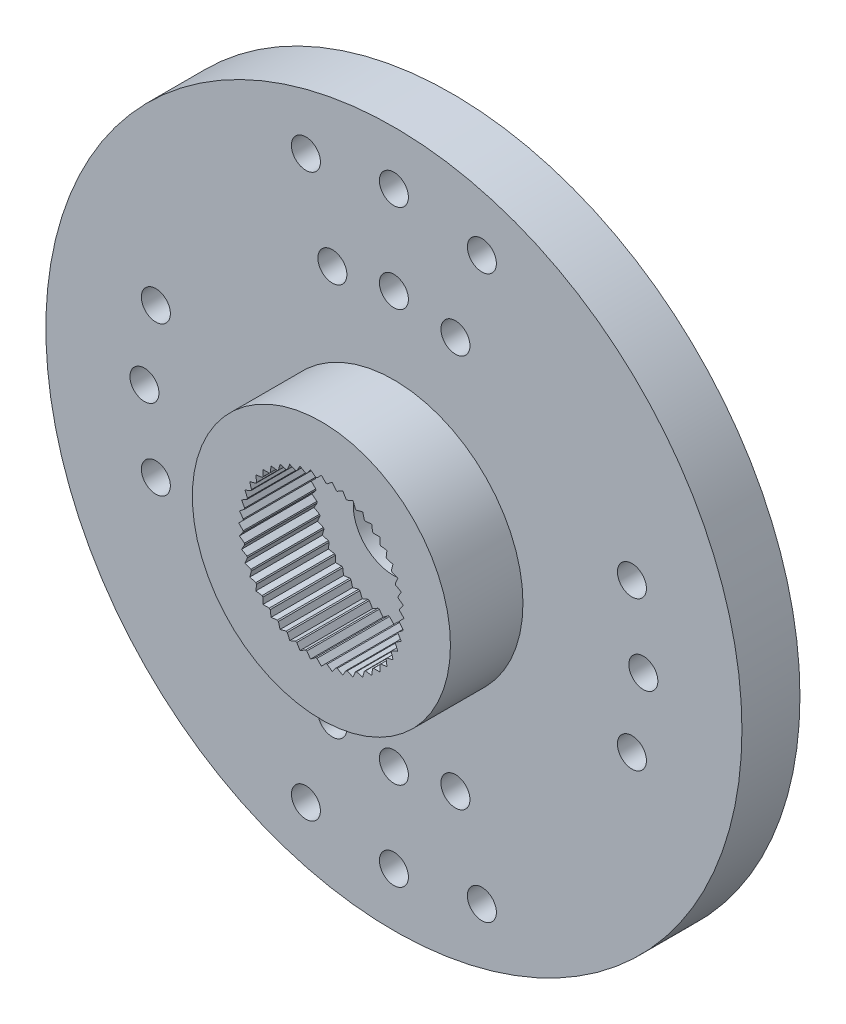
from build123d import *

# Parameters (mm, degrees)
ESQUISSE2_R             = 4.45
BOSS_EXTRU_1_DEPTH      = 3.2
BOSS_EXTRU_2_START      = -2.5
ESQUISSE3_R             = 12
ESQUISSE3_R_2           = 0.5
BOSS_EXTRU_2_DEPTH      = 2
ESQUISSE4_R             = 1.4
ENL_V_MAT_EXTRU_1_DEPTH = 18.557049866
ESQUISSE5_R             = 3.7
ESQUISSE5_R_2           = 2.9
EXTRU_MINCE1_DEPTH      = 0.4


with BuildPart() as part:
    # Esquisse2 → Boss.-Extru.1 (new body)
    with BuildSketch(Plane.XY):
        Circle(ESQUISSE2_R)
        with BuildLine():
            Line((0, 2.85), (-0.154419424, 2.695580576))
            ThreePointArc((-0.154419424, 2.695580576), (-0.176588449, 2.694219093), (-0.198745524, 2.69267529))
            Line((-0.198745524, 2.69267529), (-0.371999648, 2.825617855))
            Line((-0.371999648, 2.825617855), (-0.504942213, 2.652363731))
            ThreePointArc((-0.504942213, 2.652363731), (-0.526743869, 2.648120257), (-0.548509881, 2.643697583))
            Line((-0.548509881, 2.643697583), (-0.737634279, 2.752888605))
            Line((-0.737634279, 2.752888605), (-0.8468253, 2.563764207))
            ThreePointArc((-0.8468253, 2.563764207), (-0.867886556, 2.55671135), (-0.888889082, 2.549485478))
            Line((-0.888889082, 2.549485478), (-1.090647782, 2.633056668))
            Line((-1.090647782, 2.633056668), (-1.174218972, 2.431297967))
            ThreePointArc((-1.174218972, 2.431297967), (-1.194179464, 2.421556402), (-1.214059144, 2.411650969))
            Line((-1.214059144, 2.411650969), (-1.425, 2.468172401))
            Line((-1.425, 2.468172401), (-1.481521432, 2.257231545))
            ThreePointArc((-1.481521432, 2.257231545), (-1.500039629, 2.244967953), (-1.518456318, 2.232552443))
            Line((-1.518456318, 2.232552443), (-1.734970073, 2.26105702))
            Line((-1.734970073, 2.26105702), (-1.763474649, 2.044543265))
            ThreePointArc((-1.763474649, 2.044543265), (-1.780233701, 2.02996748), (-1.796872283, 2.015254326))
            Line((-1.796872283, 2.015254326), (-2.015254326, 2.015254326))
            Line((-2.015254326, 2.015254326), (-2.015254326, 1.796872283))
            ThreePointArc((-2.015254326, 1.796872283), (-2.02996748, 1.780233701), (-2.044543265, 1.763474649))
            Line((-2.044543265, 1.763474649), (-2.26105702, 1.734970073))
            Line((-2.26105702, 1.734970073), (-2.232552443, 1.518456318))
            ThreePointArc((-2.232552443, 1.518456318), (-2.244967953, 1.500039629), (-2.257231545, 1.481521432))
            Line((-2.257231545, 1.481521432), (-2.468172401, 1.425))
            Line((-2.468172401, 1.425), (-2.411650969, 1.214059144))
            ThreePointArc((-2.411650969, 1.214059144), (-2.421556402, 1.194179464), (-2.431297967, 1.174218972))
            Line((-2.431297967, 1.174218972), (-2.633056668, 1.090647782))
            Line((-2.633056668, 1.090647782), (-2.549485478, 0.888889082))
            ThreePointArc((-2.549485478, 0.888889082), (-2.55671135, 0.867886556), (-2.563764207, 0.8468253))
            Line((-2.563764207, 0.8468253), (-2.752888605, 0.737634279))
            Line((-2.752888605, 0.737634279), (-2.643697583, 0.548509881))
            ThreePointArc((-2.643697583, 0.548509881), (-2.648120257, 0.526743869), (-2.652363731, 0.504942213))
            Line((-2.652363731, 0.504942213), (-2.825617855, 0.371999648))
            Line((-2.825617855, 0.371999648), (-2.69267529, 0.198745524))
            ThreePointArc((-2.69267529, 0.198745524), (-2.694219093, 0.176588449), (-2.695580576, 0.154419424))
            Line((-2.695580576, 0.154419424), (-2.85, 0))
            Line((-2.85, 0), (-2.695580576, -0.154419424))
            ThreePointArc((-2.695580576, -0.154419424), (-2.694219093, -0.176588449), (-2.69267529, -0.198745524))
            Line((-2.69267529, -0.198745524), (-2.825617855, -0.371999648))
            Line((-2.825617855, -0.371999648), (-2.652363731, -0.504942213))
            ThreePointArc((-2.652363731, -0.504942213), (-2.648120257, -0.526743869), (-2.643697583, -0.548509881))
            Line((-2.643697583, -0.548509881), (-2.752888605, -0.737634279))
            Line((-2.752888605, -0.737634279), (-2.563764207, -0.8468253))
            ThreePointArc((-2.563764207, -0.8468253), (-2.55671135, -0.867886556), (-2.549485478, -0.888889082))
            Line((-2.549485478, -0.888889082), (-2.633056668, -1.090647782))
            Line((-2.633056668, -1.090647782), (-2.431297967, -1.174218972))
            ThreePointArc((-2.431297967, -1.174218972), (-2.421556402, -1.194179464), (-2.411650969, -1.214059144))
            Line((-2.411650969, -1.214059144), (-2.468172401, -1.425))
            Line((-2.468172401, -1.425), (-2.257231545, -1.481521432))
            ThreePointArc((-2.257231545, -1.481521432), (-2.244967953, -1.500039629), (-2.232552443, -1.518456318))
            Line((-2.232552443, -1.518456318), (-2.26105702, -1.734970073))
            Line((-2.26105702, -1.734970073), (-2.044543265, -1.763474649))
            ThreePointArc((-2.044543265, -1.763474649), (-2.02996748, -1.780233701), (-2.015254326, -1.796872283))
            Line((-2.015254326, -1.796872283), (-2.015254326, -2.015254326))
            Line((-2.015254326, -2.015254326), (-1.796872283, -2.015254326))
            ThreePointArc((-1.796872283, -2.015254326), (-1.780233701, -2.02996748), (-1.763474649, -2.044543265))
            Line((-1.763474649, -2.044543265), (-1.734970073, -2.26105702))
            Line((-1.734970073, -2.26105702), (-1.518456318, -2.232552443))
            ThreePointArc((-1.518456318, -2.232552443), (-1.500039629, -2.244967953), (-1.481521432, -2.257231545))
            Line((-1.481521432, -2.257231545), (-1.425, -2.468172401))
            Line((-1.425, -2.468172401), (-1.214059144, -2.411650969))
            ThreePointArc((-1.214059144, -2.411650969), (-1.194179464, -2.421556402), (-1.174218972, -2.431297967))
            Line((-1.174218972, -2.431297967), (-1.090647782, -2.633056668))
            Line((-1.090647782, -2.633056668), (-0.888889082, -2.549485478))
            ThreePointArc((-0.888889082, -2.549485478), (-0.867886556, -2.55671135), (-0.8468253, -2.563764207))
            Line((-0.8468253, -2.563764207), (-0.737634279, -2.752888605))
            Line((-0.737634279, -2.752888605), (-0.548509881, -2.643697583))
            ThreePointArc((-0.548509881, -2.643697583), (-0.526743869, -2.648120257), (-0.504942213, -2.652363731))
            Line((-0.504942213, -2.652363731), (-0.371999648, -2.825617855))
            Line((-0.371999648, -2.825617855), (-0.198745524, -2.69267529))
            ThreePointArc((-0.198745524, -2.69267529), (-0.176588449, -2.694219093), (-0.154419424, -2.695580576))
            Line((-0.154419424, -2.695580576), (0, -2.85))
            Line((0, -2.85), (0.154419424, -2.695580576))
            ThreePointArc((0.154419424, -2.695580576), (0.176588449, -2.694219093), (0.198745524, -2.69267529))
            Line((0.198745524, -2.69267529), (0.371999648, -2.825617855))
            Line((0.371999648, -2.825617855), (0.504942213, -2.652363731))
            ThreePointArc((0.504942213, -2.652363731), (0.526743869, -2.648120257), (0.548509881, -2.643697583))
            Line((0.548509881, -2.643697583), (0.737634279, -2.752888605))
            Line((0.737634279, -2.752888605), (0.8468253, -2.563764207))
            ThreePointArc((0.8468253, -2.563764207), (0.867886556, -2.55671135), (0.888889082, -2.549485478))
            Line((0.888889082, -2.549485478), (1.090647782, -2.633056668))
            Line((1.090647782, -2.633056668), (1.174218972, -2.431297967))
            ThreePointArc((1.174218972, -2.431297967), (1.194179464, -2.421556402), (1.214059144, -2.411650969))
            Line((1.214059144, -2.411650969), (1.425, -2.468172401))
            Line((1.425, -2.468172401), (1.481521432, -2.257231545))
            ThreePointArc((1.481521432, -2.257231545), (1.500039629, -2.244967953), (1.518456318, -2.232552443))
            Line((1.518456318, -2.232552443), (1.734970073, -2.26105702))
            Line((1.734970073, -2.26105702), (1.763474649, -2.044543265))
            ThreePointArc((1.763474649, -2.044543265), (1.780233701, -2.02996748), (1.796872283, -2.015254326))
            Line((1.796872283, -2.015254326), (2.015254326, -2.015254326))
            Line((2.015254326, -2.015254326), (2.015254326, -1.796872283))
            ThreePointArc((2.015254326, -1.796872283), (2.02996748, -1.780233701), (2.044543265, -1.763474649))
            Line((2.044543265, -1.763474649), (2.26105702, -1.734970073))
            Line((2.26105702, -1.734970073), (2.232552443, -1.518456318))
            ThreePointArc((2.232552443, -1.518456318), (2.244967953, -1.500039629), (2.257231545, -1.481521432))
            Line((2.257231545, -1.481521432), (2.468172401, -1.425))
            Line((2.468172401, -1.425), (2.411650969, -1.214059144))
            ThreePointArc((2.411650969, -1.214059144), (2.421556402, -1.194179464), (2.431297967, -1.174218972))
            Line((2.431297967, -1.174218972), (2.633056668, -1.090647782))
            Line((2.633056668, -1.090647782), (2.549485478, -0.888889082))
            ThreePointArc((2.549485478, -0.888889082), (2.55671135, -0.867886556), (2.563764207, -0.8468253))
            Line((2.563764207, -0.8468253), (2.752888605, -0.737634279))
            Line((2.752888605, -0.737634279), (2.643697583, -0.548509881))
            ThreePointArc((2.643697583, -0.548509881), (2.648120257, -0.526743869), (2.652363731, -0.504942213))
            Line((2.652363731, -0.504942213), (2.825617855, -0.371999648))
            Line((2.825617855, -0.371999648), (2.69267529, -0.198745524))
            ThreePointArc((2.69267529, -0.198745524), (2.694219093, -0.176588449), (2.695580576, -0.154419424))
            Line((2.695580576, -0.154419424), (2.85, 0))
            Line((2.85, 0), (2.695580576, 0.154419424))
            ThreePointArc((2.695580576, 0.154419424), (2.694219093, 0.176588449), (2.69267529, 0.198745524))
            Line((2.69267529, 0.198745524), (2.825617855, 0.371999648))
            Line((2.825617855, 0.371999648), (2.652363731, 0.504942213))
            ThreePointArc((2.652363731, 0.504942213), (2.648120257, 0.526743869), (2.643697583, 0.548509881))
            Line((2.643697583, 0.548509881), (2.752888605, 0.737634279))
            Line((2.752888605, 0.737634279), (2.563764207, 0.8468253))
            ThreePointArc((2.563764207, 0.8468253), (2.55671135, 0.867886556), (2.549485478, 0.888889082))
            Line((2.549485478, 0.888889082), (2.633056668, 1.090647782))
            Line((2.633056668, 1.090647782), (2.431297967, 1.174218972))
            ThreePointArc((2.431297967, 1.174218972), (2.421556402, 1.194179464), (2.411650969, 1.214059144))
            Line((2.411650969, 1.214059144), (2.468172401, 1.425))
            Line((2.468172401, 1.425), (2.257231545, 1.481521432))
            ThreePointArc((2.257231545, 1.481521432), (2.244967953, 1.500039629), (2.232552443, 1.518456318))
            Line((2.232552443, 1.518456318), (2.26105702, 1.734970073))
            Line((2.26105702, 1.734970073), (2.044543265, 1.763474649))
            ThreePointArc((2.044543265, 1.763474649), (2.02996748, 1.780233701), (2.015254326, 1.796872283))
            Line((2.015254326, 1.796872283), (2.015254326, 2.015254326))
            Line((2.015254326, 2.015254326), (1.796872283, 2.015254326))
            ThreePointArc((1.796872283, 2.015254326), (1.780233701, 2.02996748), (1.763474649, 2.044543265))
            Line((1.763474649, 2.044543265), (1.734970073, 2.26105702))
            Line((1.734970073, 2.26105702), (1.518456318, 2.232552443))
            ThreePointArc((1.518456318, 2.232552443), (1.500039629, 2.244967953), (1.481521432, 2.257231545))
            Line((1.481521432, 2.257231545), (1.425, 2.468172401))
            Line((1.425, 2.468172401), (1.214059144, 2.411650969))
            ThreePointArc((1.214059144, 2.411650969), (1.194179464, 2.421556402), (1.174218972, 2.431297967))
            Line((1.174218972, 2.431297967), (1.090647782, 2.633056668))
            Line((1.090647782, 2.633056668), (0.888889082, 2.549485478))
            ThreePointArc((0.888889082, 2.549485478), (0.867886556, 2.55671135), (0.8468253, 2.563764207))
            Line((0.8468253, 2.563764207), (0.737634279, 2.752888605))
            Line((0.737634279, 2.752888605), (0.548509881, 2.643697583))
            ThreePointArc((0.548509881, 2.643697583), (0.526743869, 2.648120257), (0.504942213, 2.652363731))
            Line((0.504942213, 2.652363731), (0.371999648, 2.825617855))
            Line((0.371999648, 2.825617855), (0.198745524, 2.69267529))
            ThreePointArc((0.198745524, 2.69267529), (0.176588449, 2.694219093), (0.154419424, 2.695580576))
            Line((0.154419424, 2.695580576), (0, 2.85))
        make_face(mode=Mode.SUBTRACT)
    extrude(amount=BOSS_EXTRU_1_DEPTH)

    # Esquisse3 → Boss.-Extru.2 (add)
    with BuildSketch(Plane.XY.offset(3.2).offset(BOSS_EXTRU_2_START)):
        Circle(ESQUISSE3_R)
        with Locations((-8.6, 0)):
            Circle(ESQUISSE3_R_2, mode=Mode.SUBTRACT)
        with Locations((-8.206976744, 2.570123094)):
            Circle(ESQUISSE3_R_2, mode=Mode.SUBTRACT)
        with Locations(Location((-8.206976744, -2.570123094, 0), (0, 0, 180))):
            Circle(ESQUISSE3_R_2, mode=Mode.SUBTRACT)
        with Locations((8.206976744, -2.570123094)):
            Circle(ESQUISSE3_R_2, mode=Mode.SUBTRACT)
        with Locations((8.6, 0)):
            Circle(ESQUISSE3_R_2, mode=Mode.SUBTRACT)
        with Locations(Location((8.206976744, 2.570123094, 0), (0, 0, 180))):
            Circle(ESQUISSE3_R_2, mode=Mode.SUBTRACT)
        with Locations((-3.033342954, 9.686141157)):
            Circle(ESQUISSE3_R_2, mode=Mode.SUBTRACT)
        with Locations((0, 10.15)):
            Circle(ESQUISSE3_R_2, mode=Mode.SUBTRACT)
        with Locations((3.033342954, 9.686141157)):
            Circle(ESQUISSE3_R_2, mode=Mode.SUBTRACT)
        with Locations((2.12184581, 6.775527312)):
            Circle(ESQUISSE3_R_2, mode=Mode.SUBTRACT)
        with Locations((0, 7.1)):
            Circle(ESQUISSE3_R_2, mode=Mode.SUBTRACT)
        with Locations((-2.12184581, 6.775527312)):
            Circle(ESQUISSE3_R_2, mode=Mode.SUBTRACT)
        with Locations((3.033342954, -9.686141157)):
            Circle(ESQUISSE3_R_2, mode=Mode.SUBTRACT)
        with Locations((2.12184581, -6.775527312)):
            Circle(ESQUISSE3_R_2, mode=Mode.SUBTRACT)
        with Locations((0, -10.15)):
            Circle(ESQUISSE3_R_2, mode=Mode.SUBTRACT)
        with Locations((-3.033342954, -9.686141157)):
            Circle(ESQUISSE3_R_2, mode=Mode.SUBTRACT)
        with Locations((-2.12184581, -6.775527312)):
            Circle(ESQUISSE3_R_2, mode=Mode.SUBTRACT)
        with Locations((0, -7.1)):
            Circle(ESQUISSE3_R_2, mode=Mode.SUBTRACT)
    extrude(amount=-BOSS_EXTRU_2_DEPTH)

    # Esquisse4 → Enl_v. mat.-Extru.1 (cut, through all)
    with BuildSketch(Plane(origin=(0, 0, -1.3), x_dir=(-1, 0, 0), z_dir=(0, 0, -1))):
        Circle(ESQUISSE4_R)
    extrude(amount=-ENL_V_MAT_EXTRU_1_DEPTH, mode=Mode.SUBTRACT)

    # Esquisse5 → Extru.-Mince1 (add)
    with BuildSketch(Plane(origin=(0, 0, -1.3), x_dir=(-1, 0, 0), z_dir=(0, 0, -1))):
        Circle(ESQUISSE5_R)
        Circle(ESQUISSE5_R_2, mode=Mode.SUBTRACT)
    extrude(amount=EXTRU_MINCE1_DEPTH)


solid = part.part
